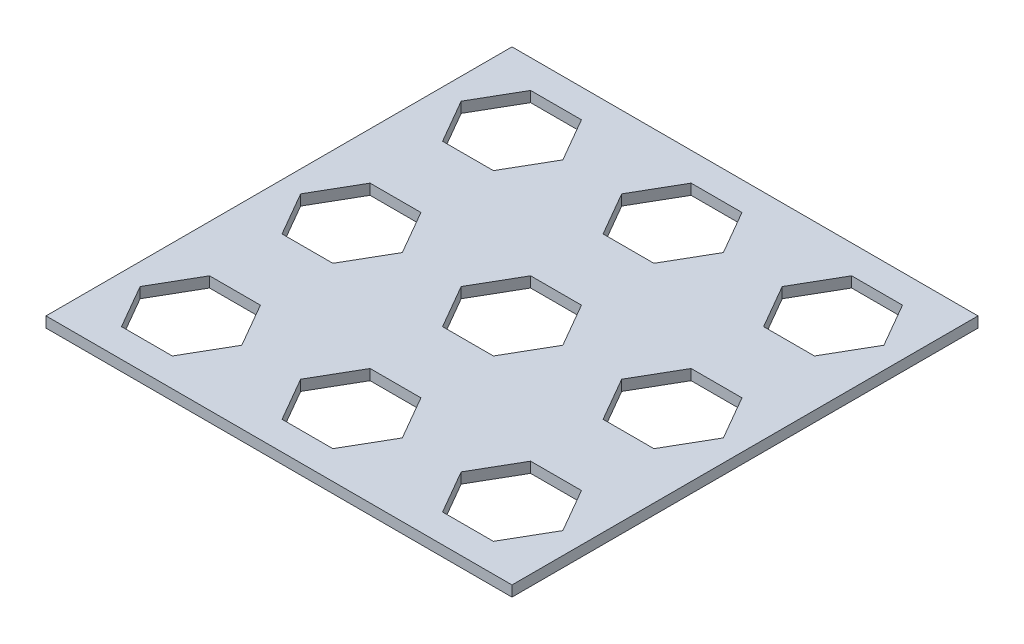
from build123d import *

# Parameters (mm, degrees)
SKETCH1_W           = 69.85
SKETCH1_H           = 69.85
BOSS_EXTRUDE1_DEPTH = 1.5875


with BuildPart() as part:
    # Sketch1 → Boss-Extrude1 (new body)
    with BuildSketch(Plane(origin=(0, 0, 0), x_dir=(1, 0, 0), z_dir=(0, 1, 0))):
        Rectangle(SKETCH1_W, SKETCH1_H)
        Polygon((-20.251613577, 30.660727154), (-27.871613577, 30.660727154), (-31.681613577, 24.061613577), (-27.871613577, 17.4625), (-20.251613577, 17.4625), (-16.441613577, 24.061613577), align=None, mode=Mode.SUBTRACT)
        Polygon((-3.81, 17.4625), (3.81, 17.4625), (7.62, 24.061613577), (3.81, 30.660727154), (-3.81, 30.660727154), (-7.62, 24.061613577), align=None, mode=Mode.SUBTRACT)
        Polygon((20.251613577, -17.4625), (16.441613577, -24.061613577), (20.251613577, -30.660727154), (27.871613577, -30.660727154), (31.681613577, -24.061613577), (27.871613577, -17.4625), align=None, mode=Mode.SUBTRACT)
        Polygon((16.441613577, 24.061613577), (20.251613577, 30.660727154), (27.871613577, 30.660727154), (31.681613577, 24.061613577), (27.871613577, 17.4625), (20.251613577, 17.4625), align=None, mode=Mode.SUBTRACT)
        Polygon((-7.62, -24.061613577), (-3.81, -17.4625), (3.81, -17.4625), (7.62, -24.061613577), (3.81, -30.660727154), (-3.81, -30.660727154), align=None, mode=Mode.SUBTRACT)
        Polygon((-16.441613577, -24.061613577), (-20.251613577, -30.660727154), (-27.871613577, -30.660727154), (-31.681613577, -24.061613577), (-27.871613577, -17.4625), (-20.251613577, -17.4625), align=None, mode=Mode.SUBTRACT)
        Polygon((20.251613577, 6.599113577), (16.441613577, 0), (20.251613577, -6.599113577), (27.871613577, -6.599113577), (31.681613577, 0), (27.871613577, 6.599113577), align=None, mode=Mode.SUBTRACT)
        Polygon((-7.62, 0), (-3.81, 6.599113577), (3.81, 6.599113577), (7.62, 0), (3.81, -6.599113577), (-3.81, -6.599113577), align=None, mode=Mode.SUBTRACT)
        Polygon((-16.441613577, 0), (-20.251613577, -6.599113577), (-27.871613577, -6.599113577), (-31.681613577, 0), (-27.871613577, 6.599113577), (-20.251613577, 6.599113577), align=None, mode=Mode.SUBTRACT)
    extrude(amount=BOSS_EXTRUDE1_DEPTH)


solid = part.part
